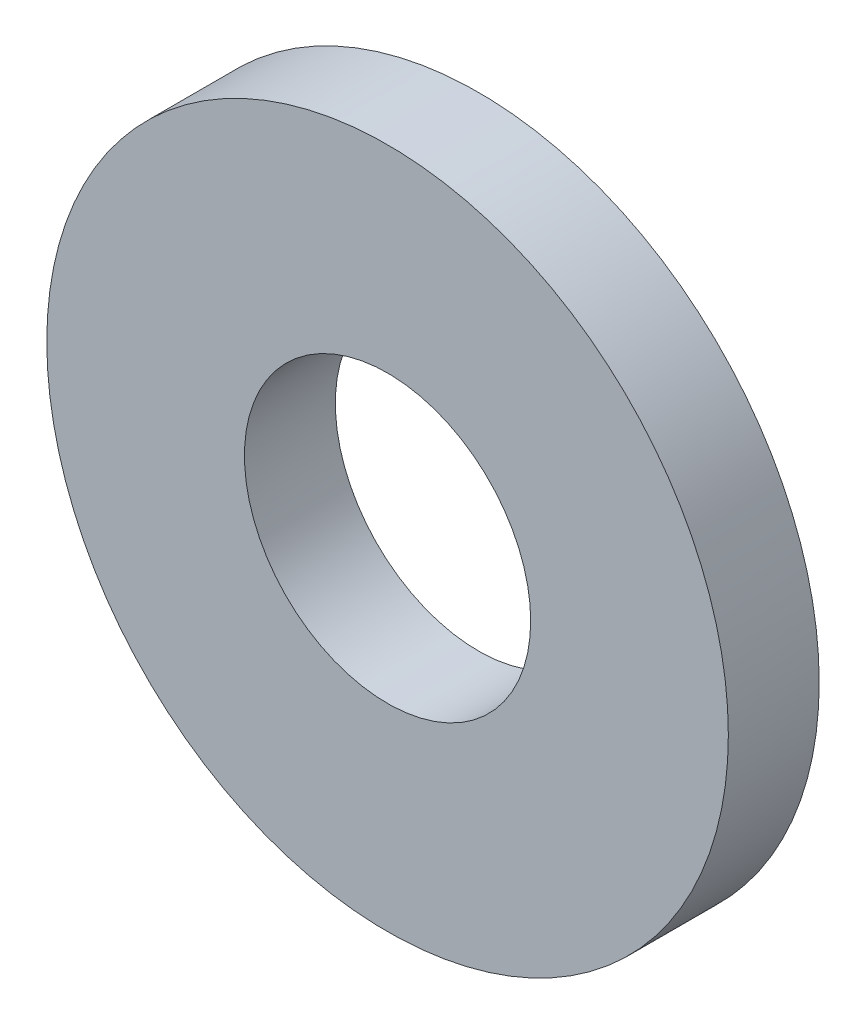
ISO-10303-21;
HEADER;
FILE_DESCRIPTION(('STEP AP214'),'2;1');
FILE_NAME('part.step','',(''),(''),'','','');
FILE_SCHEMA(('AUTOMOTIVE_DESIGN { 1 0 10303 214 1 1 1 1 }'));
ENDSEC;
DATA;
#1=APPLICATION_CONTEXT('core data for automotive mechanical design processes');
#2=APPLICATION_PROTOCOL_DEFINITION('international standard','automotive_design',2000,#1);
#3=PRODUCT_CONTEXT('',#1,'mechanical');
#4=PRODUCT('Part','Part','',(#3));
#5=PRODUCT_RELATED_PRODUCT_CATEGORY('part','',(#4));
#6=PRODUCT_DEFINITION_FORMATION('','',#4);
#7=PRODUCT_DEFINITION_CONTEXT('part definition',#1,'design');
#8=PRODUCT_DEFINITION('design','',#6,#7);
#9=PRODUCT_DEFINITION_SHAPE('','',#8);
#10=(LENGTH_UNIT() NAMED_UNIT(*) SI_UNIT(.MILLI.,.METRE.));
#11=(NAMED_UNIT(*) PLANE_ANGLE_UNIT() SI_UNIT($,.RADIAN.));
#12=(NAMED_UNIT(*) SI_UNIT($,.STERADIAN.) SOLID_ANGLE_UNIT());
#13=UNCERTAINTY_MEASURE_WITH_UNIT(LENGTH_MEASURE(1.E-05),#10,'distance_accuracy_value','');
#14=(GEOMETRIC_REPRESENTATION_CONTEXT(3) GLOBAL_UNCERTAINTY_ASSIGNED_CONTEXT((#13)) GLOBAL_UNIT_ASSIGNED_CONTEXT((#10,
#11,#12)) REPRESENTATION_CONTEXT('',''));
#15=CARTESIAN_POINT('',(0.,0.,0.));
#16=DIRECTION('',(0.,0.,1.));
#17=DIRECTION('',(1.,0.,0.));
#18=AXIS2_PLACEMENT_3D('',#15,#16,#17);
#19=CARTESIAN_POINT('',(0.,0.,40.));
#20=DIRECTION('',(0.,0.,1.));
#21=DIRECTION('',(1.,0.,0.));
#22=AXIS2_PLACEMENT_3D('',#19,#20,#21);
#23=PLANE('',#22);
#24=CARTESIAN_POINT('',(0.,0.,40.));
#25=DIRECTION('',(0.,0.,1.));
#26=DIRECTION('',(1.,0.,0.));
#27=AXIS2_PLACEMENT_3D('',#24,#25,#26);
#28=CIRCLE('',#27,150.);
#29=CARTESIAN_POINT('',(150.,0.,40.));
#30=VERTEX_POINT('',#29);
#31=EDGE_CURVE('E10',#30,#30,#28,.T.);
#32=ORIENTED_EDGE('',*,*,#31,.T.);
#33=EDGE_LOOP('',(#32));
#34=FACE_BOUND('',#33,.T.);
#35=CARTESIAN_POINT('',(0.,0.,40.));
#36=DIRECTION('',(0.,0.,1.));
#37=DIRECTION('',(1.,0.,0.));
#38=AXIS2_PLACEMENT_3D('',#35,#36,#37);
#39=CIRCLE('',#38,63.);
#40=CARTESIAN_POINT('',(63.,0.,40.));
#41=VERTEX_POINT('',#40);
#42=EDGE_CURVE('E46',#41,#41,#39,.T.);
#43=ORIENTED_EDGE('',*,*,#42,.F.);
#44=EDGE_LOOP('',(#43));
#45=FACE_BOUND('',#44,.T.);
#46=ADVANCED_FACE('F35',(#34,#45),#23,.T.);
#47=CARTESIAN_POINT('',(0.,0.,0.));
#48=DIRECTION('',(0.,0.,1.));
#49=DIRECTION('',(1.,0.,0.));
#50=AXIS2_PLACEMENT_3D('',#47,#48,#49);
#51=PLANE('',#50);
#52=CARTESIAN_POINT('',(0.,0.,0.));
#53=DIRECTION('',(0.,0.,1.));
#54=DIRECTION('',(1.,0.,0.));
#55=AXIS2_PLACEMENT_3D('',#52,#53,#54);
#56=CIRCLE('',#55,150.);
#57=CARTESIAN_POINT('',(150.,0.,0.));
#58=VERTEX_POINT('',#57);
#59=EDGE_CURVE('E39',#58,#58,#56,.T.);
#60=ORIENTED_EDGE('',*,*,#59,.F.);
#61=EDGE_LOOP('',(#60));
#62=FACE_BOUND('',#61,.T.);
#63=CARTESIAN_POINT('',(0.,0.,0.));
#64=DIRECTION('',(0.,0.,1.));
#65=DIRECTION('',(1.,0.,0.));
#66=AXIS2_PLACEMENT_3D('',#63,#64,#65);
#67=CIRCLE('',#66,63.);
#68=CARTESIAN_POINT('',(63.,0.,0.));
#69=VERTEX_POINT('',#68);
#70=EDGE_CURVE('E48',#69,#69,#67,.T.);
#71=ORIENTED_EDGE('',*,*,#70,.T.);
#72=EDGE_LOOP('',(#71));
#73=FACE_BOUND('',#72,.T.);
#74=ADVANCED_FACE('F58',(#62,#73),#51,.F.);
#75=CARTESIAN_POINT('',(0.,0.,40.));
#76=DIRECTION('',(0.,0.,-1.));
#77=DIRECTION('',(-1.,0.,0.));
#78=AXIS2_PLACEMENT_3D('',#75,#76,#77);
#79=CYLINDRICAL_SURFACE('',#78,150.);
#80=ORIENTED_EDGE('',*,*,#31,.F.);
#81=EDGE_LOOP('',(#80));
#82=FACE_BOUND('',#81,.T.);
#83=ORIENTED_EDGE('',*,*,#59,.T.);
#84=EDGE_LOOP('',(#83));
#85=FACE_BOUND('',#84,.T.);
#86=ADVANCED_FACE('F37',(#82,#85),#79,.T.);
#87=CARTESIAN_POINT('',(0.,0.,40.));
#88=DIRECTION('',(0.,0.,-1.));
#89=DIRECTION('',(-1.,0.,0.));
#90=AXIS2_PLACEMENT_3D('',#87,#88,#89);
#91=CYLINDRICAL_SURFACE('',#90,63.);
#92=ORIENTED_EDGE('',*,*,#42,.T.);
#93=EDGE_LOOP('',(#92));
#94=FACE_BOUND('',#93,.T.);
#95=ORIENTED_EDGE('',*,*,#70,.F.);
#96=EDGE_LOOP('',(#95));
#97=FACE_BOUND('',#96,.T.);
#98=ADVANCED_FACE('F54',(#94,#97),#91,.F.);
#99=CLOSED_SHELL('',(#46,#74,#86,#98));
#100=MANIFOLD_SOLID_BREP('B2',#99);
#101=ADVANCED_BREP_SHAPE_REPRESENTATION('',(#18,#100),#14);
#102=SHAPE_DEFINITION_REPRESENTATION(#9,#101);
ENDSEC;
END-ISO-10303-21;
